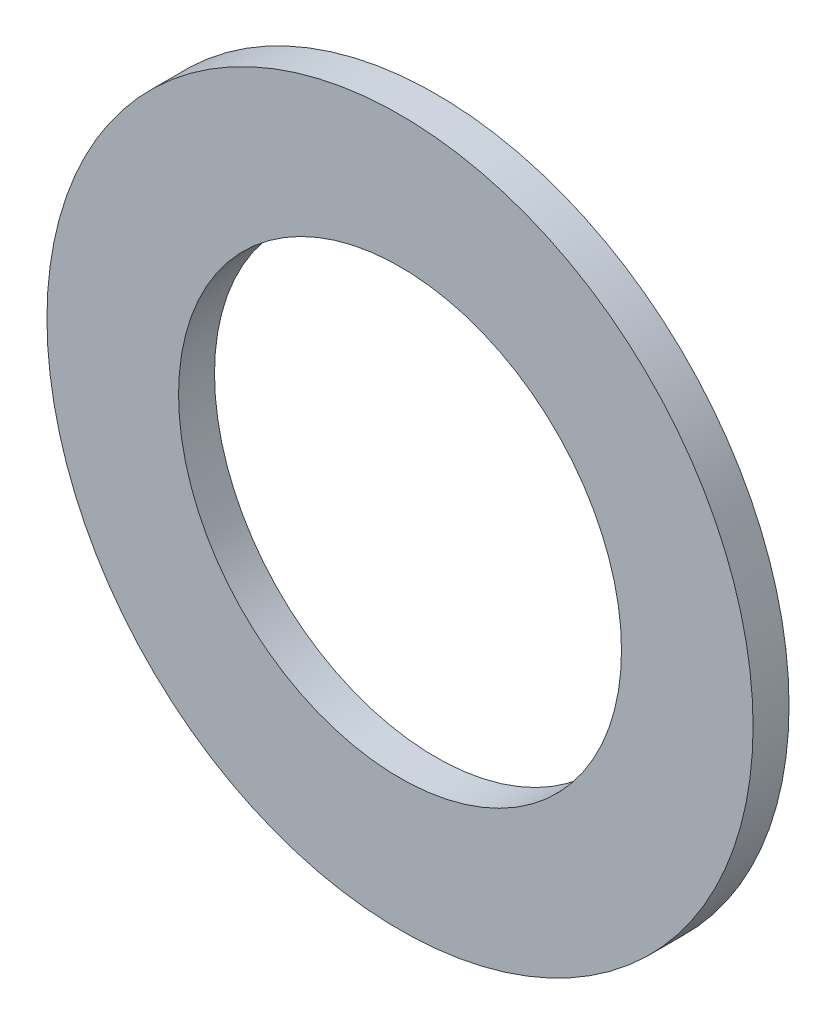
ISO-10303-21;
HEADER;
FILE_DESCRIPTION(('STEP AP214'),'2;1');
FILE_NAME('part.step','',(''),(''),'','','');
FILE_SCHEMA(('AUTOMOTIVE_DESIGN { 1 0 10303 214 1 1 1 1 }'));
ENDSEC;
DATA;
#1=APPLICATION_CONTEXT('core data for automotive mechanical design processes');
#2=APPLICATION_PROTOCOL_DEFINITION('international standard','automotive_design',2000,#1);
#3=PRODUCT_CONTEXT('',#1,'mechanical');
#4=PRODUCT('Part','Part','',(#3));
#5=PRODUCT_RELATED_PRODUCT_CATEGORY('part','',(#4));
#6=PRODUCT_DEFINITION_FORMATION('','',#4);
#7=PRODUCT_DEFINITION_CONTEXT('part definition',#1,'design');
#8=PRODUCT_DEFINITION('design','',#6,#7);
#9=PRODUCT_DEFINITION_SHAPE('','',#8);
#10=(LENGTH_UNIT() NAMED_UNIT(*) SI_UNIT(.MILLI.,.METRE.));
#11=(NAMED_UNIT(*) PLANE_ANGLE_UNIT() SI_UNIT($,.RADIAN.));
#12=(NAMED_UNIT(*) SI_UNIT($,.STERADIAN.) SOLID_ANGLE_UNIT());
#13=UNCERTAINTY_MEASURE_WITH_UNIT(LENGTH_MEASURE(1.E-05),#10,'distance_accuracy_value','');
#14=(GEOMETRIC_REPRESENTATION_CONTEXT(3) GLOBAL_UNCERTAINTY_ASSIGNED_CONTEXT((#13)) GLOBAL_UNIT_ASSIGNED_CONTEXT((#10,
#11,#12)) REPRESENTATION_CONTEXT('',''));
#15=CARTESIAN_POINT('',(0.,0.,0.));
#16=DIRECTION('',(0.,0.,1.));
#17=DIRECTION('',(1.,0.,0.));
#18=AXIS2_PLACEMENT_3D('',#15,#16,#17);
#19=CARTESIAN_POINT('',(0.,0.,1.5875));
#20=DIRECTION('',(0.,0.,1.));
#21=DIRECTION('',(1.,0.,0.));
#22=AXIS2_PLACEMENT_3D('',#19,#20,#21);
#23=PLANE('',#22);
#24=CARTESIAN_POINT('',(0.,0.,1.5875));
#25=DIRECTION('',(0.,0.,1.));
#26=DIRECTION('',(1.,0.,0.));
#27=AXIS2_PLACEMENT_3D('',#24,#25,#26);
#28=CIRCLE('',#27,15.58925);
#29=CARTESIAN_POINT('',(15.58925,0.,1.5875));
#30=VERTEX_POINT('',#29);
#31=EDGE_CURVE('E10',#30,#30,#28,.T.);
#32=ORIENTED_EDGE('',*,*,#31,.T.);
#33=EDGE_LOOP('',(#32));
#34=FACE_BOUND('',#33,.T.);
#35=CARTESIAN_POINT('',(0.,0.,1.5875));
#36=DIRECTION('',(0.,0.,1.));
#37=DIRECTION('',(1.,0.,0.));
#38=AXIS2_PLACEMENT_3D('',#35,#36,#37);
#39=CIRCLE('',#38,9.779);
#40=CARTESIAN_POINT('',(9.779,0.,1.5875));
#41=VERTEX_POINT('',#40);
#42=EDGE_CURVE('E40',#41,#41,#39,.T.);
#43=ORIENTED_EDGE('',*,*,#42,.F.);
#44=EDGE_LOOP('',(#43));
#45=FACE_BOUND('',#44,.T.);
#46=ADVANCED_FACE('F29',(#34,#45),#23,.T.);
#47=CARTESIAN_POINT('',(0.,0.,0.));
#48=DIRECTION('',(0.,0.,1.));
#49=DIRECTION('',(1.,0.,0.));
#50=AXIS2_PLACEMENT_3D('',#47,#48,#49);
#51=PLANE('',#50);
#52=CARTESIAN_POINT('',(0.,0.,0.));
#53=DIRECTION('',(0.,0.,1.));
#54=DIRECTION('',(1.,0.,0.));
#55=AXIS2_PLACEMENT_3D('',#52,#53,#54);
#56=CIRCLE('',#55,15.58925);
#57=CARTESIAN_POINT('',(15.58925,0.,0.));
#58=VERTEX_POINT('',#57);
#59=EDGE_CURVE('E36',#58,#58,#56,.T.);
#60=ORIENTED_EDGE('',*,*,#59,.F.);
#61=EDGE_LOOP('',(#60));
#62=FACE_BOUND('',#61,.T.);
#63=CARTESIAN_POINT('',(0.,0.,0.));
#64=DIRECTION('',(0.,0.,1.));
#65=DIRECTION('',(1.,0.,0.));
#66=AXIS2_PLACEMENT_3D('',#63,#64,#65);
#67=CIRCLE('',#66,9.779);
#68=CARTESIAN_POINT('',(9.779,0.,0.));
#69=VERTEX_POINT('',#68);
#70=EDGE_CURVE('E44',#69,#69,#67,.T.);
#71=ORIENTED_EDGE('',*,*,#70,.T.);
#72=EDGE_LOOP('',(#71));
#73=FACE_BOUND('',#72,.T.);
#74=ADVANCED_FACE('F50',(#62,#73),#51,.F.);
#75=CARTESIAN_POINT('',(0.,0.,1.5875));
#76=DIRECTION('',(0.,0.,-1.));
#77=DIRECTION('',(-1.,0.,0.));
#78=AXIS2_PLACEMENT_3D('',#75,#76,#77);
#79=CYLINDRICAL_SURFACE('',#78,15.58925);
#80=ORIENTED_EDGE('',*,*,#31,.F.);
#81=EDGE_LOOP('',(#80));
#82=FACE_BOUND('',#81,.T.);
#83=ORIENTED_EDGE('',*,*,#59,.T.);
#84=EDGE_LOOP('',(#83));
#85=FACE_BOUND('',#84,.T.);
#86=ADVANCED_FACE('F31',(#82,#85),#79,.T.);
#87=CARTESIAN_POINT('',(0.,0.,1.5875));
#88=DIRECTION('',(0.,0.,-1.));
#89=DIRECTION('',(-1.,0.,0.));
#90=AXIS2_PLACEMENT_3D('',#87,#88,#89);
#91=CYLINDRICAL_SURFACE('',#90,9.779);
#92=ORIENTED_EDGE('',*,*,#42,.T.);
#93=EDGE_LOOP('',(#92));
#94=FACE_BOUND('',#93,.T.);
#95=ORIENTED_EDGE('',*,*,#70,.F.);
#96=EDGE_LOOP('',(#95));
#97=FACE_BOUND('',#96,.T.);
#98=ADVANCED_FACE('F52',(#94,#97),#91,.F.);
#99=CLOSED_SHELL('',(#46,#74,#86,#98));
#100=MANIFOLD_SOLID_BREP('B2',#99);
#101=ADVANCED_BREP_SHAPE_REPRESENTATION('',(#18,#100),#14);
#102=SHAPE_DEFINITION_REPRESENTATION(#9,#101);
ENDSEC;
END-ISO-10303-21;
